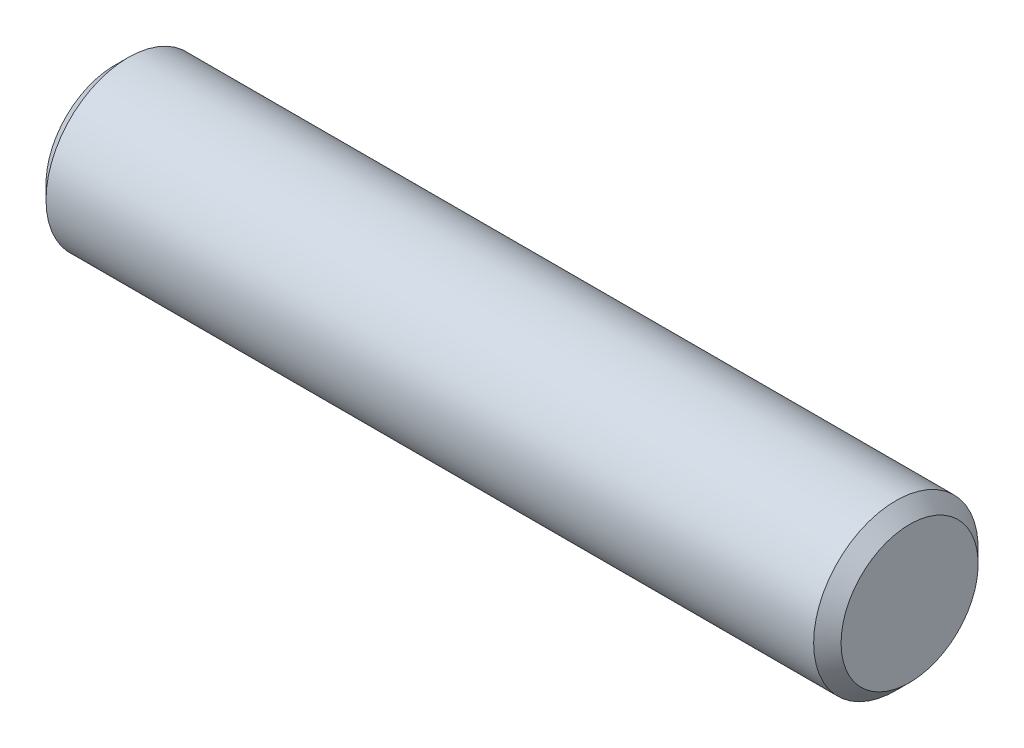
from build123d import *

# Parameters (mm, degrees)
ESQUISSE1_W     = 29
ESQUISSE1_H     = 3
CHANFREIN1_SIZE = 0.5


with BuildPart() as part:
    # Esquisse1 → R_volution1 (revolve)
    with BuildSketch(Plane.XY, mode=Mode.PRIVATE) as r_volution1_sk:
        with Locations((-5.821883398, 12.653405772)):
            Rectangle(ESQUISSE1_W, ESQUISSE1_H)
    revolve(r_volution1_sk.sketch.rotate(Axis((-42.250613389, 11.153405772, 0), (1, 0, 0)), 90), axis=Axis((-42.250613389, 11.153405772, 0), (1, 0, 0)))

    # Chanfrein1
    chanfrein1_edges = [part.edges().sort_by_distance(p)[0] for p in [
        (-20.321883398, 11.153405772, -3),
        (8.678116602, 11.153405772, -3),
    ]]
    chamfer(chanfrein1_edges, length=CHANFREIN1_SIZE)


solid = part.part
